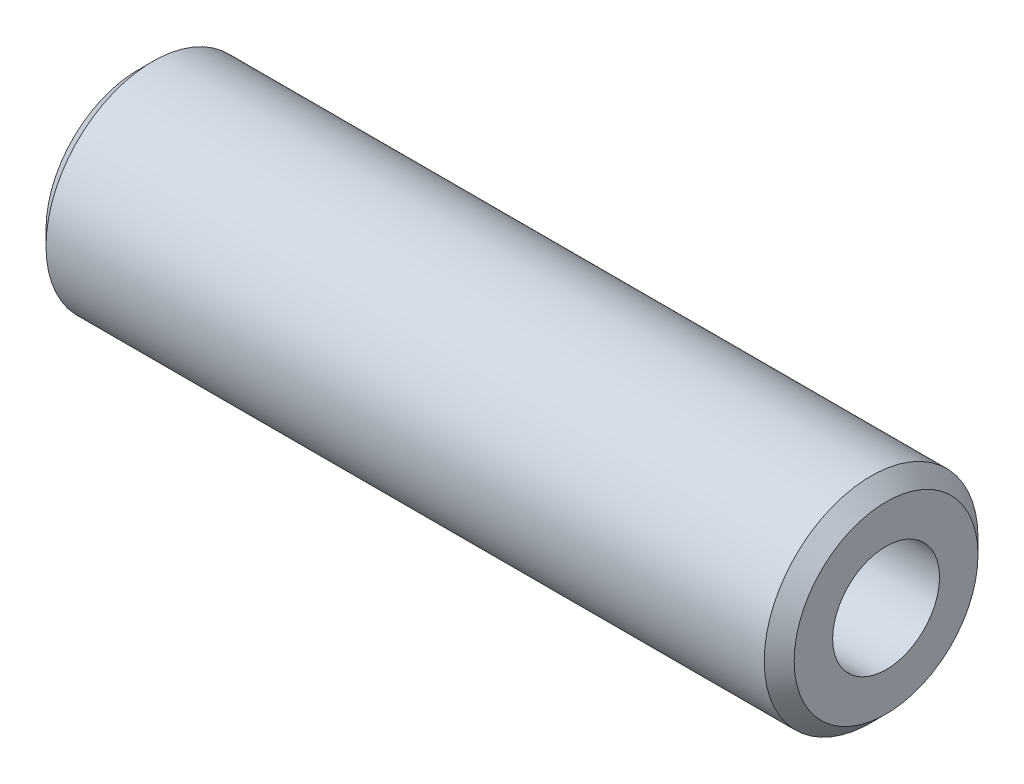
from build123d import *

# Parameters (mm, degrees)
SKETCH1_W     = 44.45
SKETCH1_H     = 3.175
CHAMFER1_SIZE = 0.889


with BuildPart() as part:
    # Sketch1 → Revolve1 (revolve)
    with BuildSketch(Plane.XY, mode=Mode.PRIVATE) as revolve1_sk:
        with Locations((22.225, 4.7625)):
            Rectangle(SKETCH1_W, SKETCH1_H)
    revolve(revolve1_sk.sketch.rotate(Axis((0, 0, 0), (1, 0, 0)), 90), axis=Axis((0, 0, 0), (1, 0, 0)))

    # Chamfer1
    chamfer1_edges = [part.edges().sort_by_distance(p)[0] for p in [
        (0, 0, -6.35),
        (44.45, 0, -6.35),
    ]]
    chamfer(chamfer1_edges, length=CHAMFER1_SIZE)


solid = part.part
